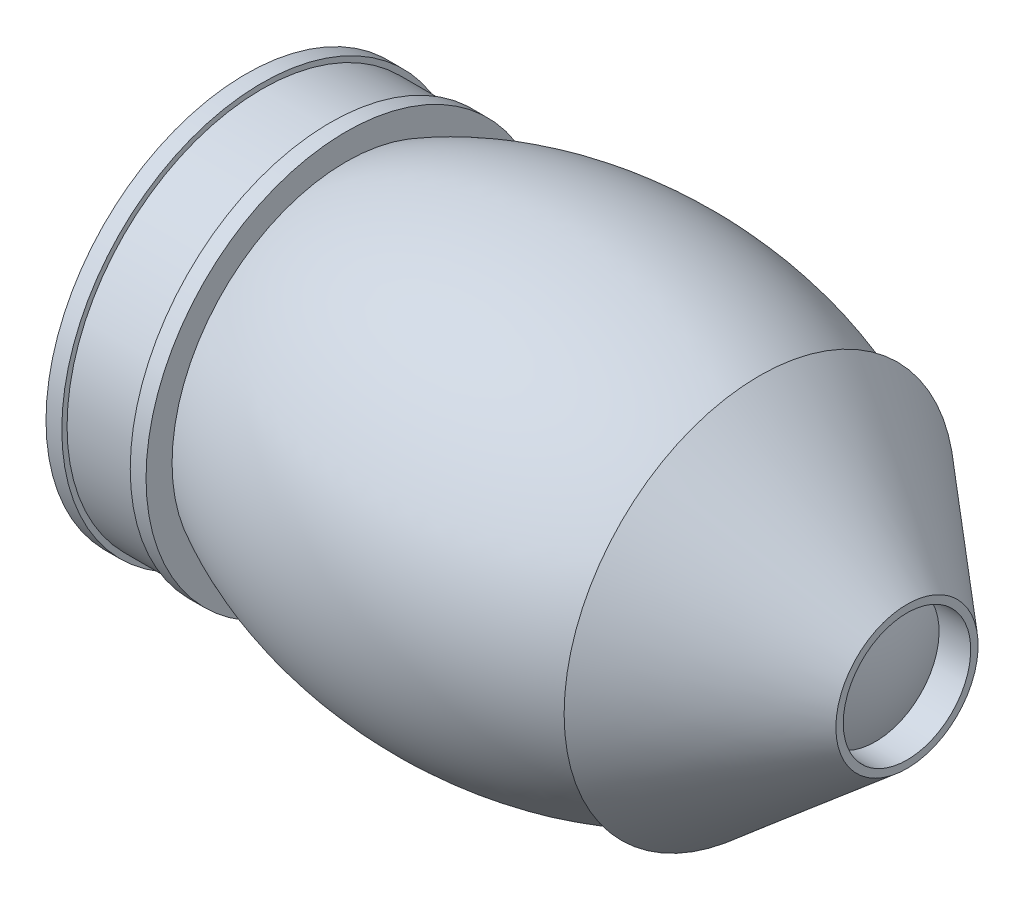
ISO-10303-21;
HEADER;
FILE_DESCRIPTION(('STEP AP214'),'2;1');
FILE_NAME('part.step','',(''),(''),'','','');
FILE_SCHEMA(('AUTOMOTIVE_DESIGN { 1 0 10303 214 1 1 1 1 }'));
ENDSEC;
DATA;
#1=APPLICATION_CONTEXT('core data for automotive mechanical design processes');
#2=APPLICATION_PROTOCOL_DEFINITION('international standard','automotive_design',2000,#1);
#3=PRODUCT_CONTEXT('',#1,'mechanical');
#4=PRODUCT('Part','Part','',(#3));
#5=PRODUCT_RELATED_PRODUCT_CATEGORY('part','',(#4));
#6=PRODUCT_DEFINITION_FORMATION('','',#4);
#7=PRODUCT_DEFINITION_CONTEXT('part definition',#1,'design');
#8=PRODUCT_DEFINITION('design','',#6,#7);
#9=PRODUCT_DEFINITION_SHAPE('','',#8);
#10=(LENGTH_UNIT() NAMED_UNIT(*) SI_UNIT(.MILLI.,.METRE.));
#11=(NAMED_UNIT(*) PLANE_ANGLE_UNIT() SI_UNIT($,.RADIAN.));
#12=(NAMED_UNIT(*) SI_UNIT($,.STERADIAN.) SOLID_ANGLE_UNIT());
#13=UNCERTAINTY_MEASURE_WITH_UNIT(LENGTH_MEASURE(1.E-05),#10,'distance_accuracy_value','');
#14=(GEOMETRIC_REPRESENTATION_CONTEXT(3) GLOBAL_UNCERTAINTY_ASSIGNED_CONTEXT((#13)) GLOBAL_UNIT_ASSIGNED_CONTEXT((#10,
#11,#12)) REPRESENTATION_CONTEXT('',''));
#15=CARTESIAN_POINT('',(0.,0.,0.));
#16=DIRECTION('',(0.,0.,1.));
#17=DIRECTION('',(1.,0.,0.));
#18=AXIS2_PLACEMENT_3D('',#15,#16,#17);
#19=CARTESIAN_POINT('',(63.5,0.,0.));
#20=DIRECTION('',(0.,0.,1.));
#21=DIRECTION('',(-1.,0.,0.));
#22=AXIS2_PLACEMENT_3D('',#19,#20,#21);
#23=ELLIPSE('',#22,95.25,63.5);
#24=TRIMMED_CURVE('',#23,(PARAMETER_VALUE(3.14159265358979)),
(PARAMETER_VALUE(6.28318530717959)),.T.,.PARAMETER.);
#25=CARTESIAN_POINT('',(-100.872846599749,0.,0.));
#26=DIRECTION('',(-1.,0.,0.));
#27=AXIS1_PLACEMENT('',#25,#26);
#28=SURFACE_OF_REVOLUTION('',#24,#27);
#29=CARTESIAN_POINT('',(3.99300739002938,0.,0.));
#30=DIRECTION('',(-1.,0.,0.));
#31=DIRECTION('',(0.,0.,1.));
#32=AXIS2_PLACEMENT_3D('',#29,#30,#31);
#33=CIRCLE('',#32,49.5826149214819);
#34=CARTESIAN_POINT('',(3.99300739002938,0.,49.5826149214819));
#35=VERTEX_POINT('',#34);
#36=EDGE_CURVE('E59',#35,#35,#33,.T.);
#37=ORIENTED_EDGE('',*,*,#36,.F.);
#38=EDGE_LOOP('',(#37));
#39=FACE_BOUND('',#38,.T.);
#40=CARTESIAN_POINT('',(119.373234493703,0.,0.));
#41=DIRECTION('',(-1.,0.,0.));
#42=DIRECTION('',(0.,0.,1.));
#43=AXIS2_PLACEMENT_3D('',#40,#41,#42);
#44=CIRCLE('',#43,51.4273777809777);
#45=CARTESIAN_POINT('',(119.373234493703,0.,51.4273777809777));
#46=VERTEX_POINT('',#45);
#47=EDGE_CURVE('E45',#46,#46,#44,.F.);
#48=ORIENTED_EDGE('',*,*,#47,.F.);
#49=EDGE_LOOP('',(#48));
#50=FACE_BOUND('',#49,.T.);
#51=ADVANCED_FACE('F36',(#39,#50),#28,.T.);
#52=CARTESIAN_POINT('',(-31.75,0.,0.));
#53=VERTEX_POINT('',#52);
#54=VERTEX_LOOP('',#53);
#55=FACE_BOUND('',#54,.T.);
#56=CARTESIAN_POINT('',(-24.5069926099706,0.,0.));
#57=DIRECTION('',(-1.,0.,0.));
#58=DIRECTION('',(0.,0.,1.));
#59=AXIS2_PLACEMENT_3D('',#56,#57,#58);
#60=CIRCLE('',#59,24.2883762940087);
#61=CARTESIAN_POINT('',(-24.5069926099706,0.,24.2883762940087));
#62=VERTEX_POINT('',#61);
#63=EDGE_CURVE('E57',#62,#62,#60,.F.);
#64=ORIENTED_EDGE('',*,*,#63,.F.);
#65=EDGE_LOOP('',(#64));
#66=FACE_BOUND('',#65,.T.);
#67=ADVANCED_FACE('F38',(#55,#66),#28,.T.);
#68=CARTESIAN_POINT('',(-24.5069926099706,57.,0.));
#69=DIRECTION('',(1.,0.,0.));
#70=DIRECTION('',(0.,0.,-1.));
#71=AXIS2_PLACEMENT_3D('',#68,#69,#70);
#72=PLANE('',#71);
#73=CARTESIAN_POINT('',(-24.5069926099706,0.,0.));
#74=DIRECTION('',(-1.,0.,0.));
#75=DIRECTION('',(0.,0.,1.));
#76=AXIS2_PLACEMENT_3D('',#73,#74,#75);
#77=CIRCLE('',#76,57.);
#78=CARTESIAN_POINT('',(-24.5069926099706,0.,57.));
#79=VERTEX_POINT('',#78);
#80=EDGE_CURVE('E78',#79,#79,#77,.T.);
#81=ORIENTED_EDGE('',*,*,#80,.T.);
#82=EDGE_LOOP('',(#81));
#83=FACE_BOUND('',#82,.T.);
#84=ORIENTED_EDGE('',*,*,#63,.T.);
#85=EDGE_LOOP('',(#84));
#86=FACE_BOUND('',#85,.T.);
#87=ADVANCED_FACE('F53',(#83,#86),#72,.F.);
#88=CARTESIAN_POINT('',(3.99300739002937,0.,0.));
#89=DIRECTION('',(-1.,0.,0.));
#90=DIRECTION('',(0.,0.,1.));
#91=AXIS2_PLACEMENT_3D('',#88,#89,#90);
#92=PLANE('',#91);
#93=CARTESIAN_POINT('',(3.99300739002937,0.,0.));
#94=DIRECTION('',(-1.,0.,0.));
#95=DIRECTION('',(0.,0.,1.));
#96=AXIS2_PLACEMENT_3D('',#93,#94,#95);
#97=CIRCLE('',#96,57.);
#98=CARTESIAN_POINT('',(3.99300739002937,0.,57.));
#99=VERTEX_POINT('',#98);
#100=EDGE_CURVE('E81',#99,#99,#97,.T.);
#101=ORIENTED_EDGE('',*,*,#100,.F.);
#102=EDGE_LOOP('',(#101));
#103=FACE_BOUND('',#102,.T.);
#104=ORIENTED_EDGE('',*,*,#36,.T.);
#105=EDGE_LOOP('',(#104));
#106=FACE_BOUND('',#105,.T.);
#107=ADVANCED_FACE('F131',(#103,#106),#92,.F.);
#108=CARTESIAN_POINT('',(-41.4029714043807,0.,0.));
#109=DIRECTION('',(-1.,0.,0.));
#110=DIRECTION('',(0.,0.,1.));
#111=AXIS2_PLACEMENT_3D('',#108,#109,#110);
#112=CYLINDRICAL_SURFACE('',#111,57.);
#113=CARTESIAN_POINT('',(-0.506992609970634,0.,0.));
#114=DIRECTION('',(-1.,0.,0.));
#115=DIRECTION('',(0.,0.,1.));
#116=AXIS2_PLACEMENT_3D('',#113,#114,#115);
#117=CIRCLE('',#116,57.);
#118=CARTESIAN_POINT('',(-0.506992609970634,0.,57.));
#119=VERTEX_POINT('',#118);
#120=EDGE_CURVE('E63',#119,#119,#117,.T.);
#121=ORIENTED_EDGE('',*,*,#120,.F.);
#122=EDGE_LOOP('',(#121));
#123=FACE_BOUND('',#122,.T.);
#124=ORIENTED_EDGE('',*,*,#100,.T.);
#125=EDGE_LOOP('',(#124));
#126=FACE_BOUND('',#125,.T.);
#127=ADVANCED_FACE('F134',(#123,#126),#112,.T.);
#128=CARTESIAN_POINT('',(-0.506992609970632,57.,0.));
#129=DIRECTION('',(1.,0.,0.));
#130=DIRECTION('',(0.,0.,-1.));
#131=AXIS2_PLACEMENT_3D('',#128,#129,#130);
#132=PLANE('',#131);
#133=CARTESIAN_POINT('',(-0.506992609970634,0.,0.));
#134=DIRECTION('',(-1.,0.,0.));
#135=DIRECTION('',(0.,0.,1.));
#136=AXIS2_PLACEMENT_3D('',#133,#134,#135);
#137=CIRCLE('',#136,55.5);
#138=CARTESIAN_POINT('',(-0.506992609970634,0.,55.5));
#139=VERTEX_POINT('',#138);
#140=EDGE_CURVE('E69',#139,#139,#137,.T.);
#141=ORIENTED_EDGE('',*,*,#140,.F.);
#142=EDGE_LOOP('',(#141));
#143=FACE_BOUND('',#142,.T.);
#144=ORIENTED_EDGE('',*,*,#120,.T.);
#145=EDGE_LOOP('',(#144));
#146=FACE_BOUND('',#145,.T.);
#147=ADVANCED_FACE('F149',(#143,#146),#132,.F.);
#148=CARTESIAN_POINT('',(-41.4029714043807,0.,0.));
#149=DIRECTION('',(-1.,0.,0.));
#150=DIRECTION('',(0.,0.,1.));
#151=AXIS2_PLACEMENT_3D('',#148,#149,#150);
#152=CYLINDRICAL_SURFACE('',#151,55.5);
#153=CARTESIAN_POINT('',(-20.0069926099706,0.,0.));
#154=DIRECTION('',(-1.,0.,0.));
#155=DIRECTION('',(0.,0.,1.));
#156=AXIS2_PLACEMENT_3D('',#153,#154,#155);
#157=CIRCLE('',#156,55.5);
#158=CARTESIAN_POINT('',(-20.0069926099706,0.,55.5));
#159=VERTEX_POINT('',#158);
#160=EDGE_CURVE('E72',#159,#159,#157,.T.);
#161=ORIENTED_EDGE('',*,*,#160,.F.);
#162=EDGE_LOOP('',(#161));
#163=FACE_BOUND('',#162,.T.);
#164=ORIENTED_EDGE('',*,*,#140,.T.);
#165=EDGE_LOOP('',(#164));
#166=FACE_BOUND('',#165,.T.);
#167=ADVANCED_FACE('F145',(#163,#166),#152,.T.);
#168=CARTESIAN_POINT('',(-20.0069926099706,55.5,0.));
#169=DIRECTION('',(-1.,0.,0.));
#170=DIRECTION('',(0.,0.,1.));
#171=AXIS2_PLACEMENT_3D('',#168,#169,#170);
#172=PLANE('',#171);
#173=CARTESIAN_POINT('',(-20.0069926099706,0.,0.));
#174=DIRECTION('',(-1.,0.,0.));
#175=DIRECTION('',(0.,0.,1.));
#176=AXIS2_PLACEMENT_3D('',#173,#174,#175);
#177=CIRCLE('',#176,57.);
#178=CARTESIAN_POINT('',(-20.0069926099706,0.,57.));
#179=VERTEX_POINT('',#178);
#180=EDGE_CURVE('E75',#179,#179,#177,.T.);
#181=ORIENTED_EDGE('',*,*,#180,.F.);
#182=EDGE_LOOP('',(#181));
#183=FACE_BOUND('',#182,.T.);
#184=ORIENTED_EDGE('',*,*,#160,.T.);
#185=EDGE_LOOP('',(#184));
#186=FACE_BOUND('',#185,.T.);
#187=ADVANCED_FACE('F141',(#183,#186),#172,.F.);
#188=CARTESIAN_POINT('',(-41.4029714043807,0.,0.));
#189=DIRECTION('',(-1.,0.,0.));
#190=DIRECTION('',(0.,0.,1.));
#191=AXIS2_PLACEMENT_3D('',#188,#189,#190);
#192=CYLINDRICAL_SURFACE('',#191,57.);
#193=ORIENTED_EDGE('',*,*,#80,.F.);
#194=EDGE_LOOP('',(#193));
#195=FACE_BOUND('',#194,.T.);
#196=ORIENTED_EDGE('',*,*,#180,.T.);
#197=EDGE_LOOP('',(#196));
#198=FACE_BOUND('',#197,.T.);
#199=ADVANCED_FACE('F112',(#195,#198),#192,.T.);
#200=CARTESIAN_POINT('',(-41.4029714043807,0.,0.));
#201=DIRECTION('',(-1.,0.,0.));
#202=DIRECTION('',(0.,0.,1.));
#203=AXIS2_PLACEMENT_3D('',#200,#201,#202);
#204=CYLINDRICAL_SURFACE('',#203,18.1540898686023);
#205=CARTESIAN_POINT('',(163.789229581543,0.,0.));
#206=DIRECTION('',(-1.,0.,0.));
#207=DIRECTION('',(0.,0.,1.));
#208=AXIS2_PLACEMENT_3D('',#205,#206,#207);
#209=CIRCLE('',#208,18.1540898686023);
#210=CARTESIAN_POINT('',(163.789229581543,0.,18.1540898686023));
#211=VERTEX_POINT('',#210);
#212=EDGE_CURVE('E84',#211,#211,#209,.T.);
#213=ORIENTED_EDGE('',*,*,#212,.F.);
#214=EDGE_LOOP('',(#213));
#215=FACE_BOUND('',#214,.T.);
#216=CARTESIAN_POINT('',(154.774464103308,0.,0.));
#217=DIRECTION('',(-1.,0.,0.));
#218=DIRECTION('',(0.,0.,1.));
#219=AXIS2_PLACEMENT_3D('',#216,#217,#218);
#220=CIRCLE('',#219,18.1540898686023);
#221=CARTESIAN_POINT('',(154.774464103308,0.,18.1540898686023));
#222=VERTEX_POINT('',#221);
#223=EDGE_CURVE('E11',#222,#222,#220,.T.);
#224=ORIENTED_EDGE('',*,*,#223,.T.);
#225=EDGE_LOOP('',(#224));
#226=FACE_BOUND('',#225,.T.);
#227=ADVANCED_FACE('F109',(#215,#226),#204,.F.);
#228=CARTESIAN_POINT('',(121.748755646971,0.,0.));
#229=DIRECTION('',(1.,0.,0.));
#230=DIRECTION('',(0.,0.,-1.));
#231=AXIS2_PLACEMENT_3D('',#228,#229,#230);
#232=CONICAL_SURFACE('',#231,55.643211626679,1.05766577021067);
#233=CARTESIAN_POINT('',(121.748755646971,0.,0.));
#234=DIRECTION('',(-1.,0.,0.));
#235=DIRECTION('',(0.,0.,1.));
#236=AXIS2_PLACEMENT_3D('',#233,#234,#235);
#237=CIRCLE('',#236,55.643211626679);
#238=CARTESIAN_POINT('',(121.748755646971,0.,55.643211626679));
#239=VERTEX_POINT('',#238);
#240=EDGE_CURVE('E90',#239,#239,#237,.T.);
#241=ORIENTED_EDGE('',*,*,#240,.T.);
#242=EDGE_LOOP('',(#241));
#243=FACE_BOUND('',#242,.T.);
#244=ORIENTED_EDGE('',*,*,#47,.T.);
#245=EDGE_LOOP('',(#244));
#246=FACE_BOUND('',#245,.T.);
#247=ADVANCED_FACE('F94',(#243,#246),#232,.T.);
#248=CARTESIAN_POINT('',(163.789229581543,20.2678038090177,0.));
#249=DIRECTION('',(-1.,0.,0.));
#250=DIRECTION('',(0.,0.,1.));
#251=AXIS2_PLACEMENT_3D('',#248,#249,#250);
#252=PLANE('',#251);
#253=CARTESIAN_POINT('',(163.789229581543,0.,0.));
#254=DIRECTION('',(-1.,0.,0.));
#255=DIRECTION('',(0.,0.,1.));
#256=AXIS2_PLACEMENT_3D('',#253,#254,#255);
#257=CIRCLE('',#256,20.2678038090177);
#258=CARTESIAN_POINT('',(163.789229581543,0.,20.2678038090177));
#259=VERTEX_POINT('',#258);
#260=EDGE_CURVE('E87',#259,#259,#257,.T.);
#261=ORIENTED_EDGE('',*,*,#260,.F.);
#262=EDGE_LOOP('',(#261));
#263=FACE_BOUND('',#262,.T.);
#264=ORIENTED_EDGE('',*,*,#212,.T.);
#265=EDGE_LOOP('',(#264));
#266=FACE_BOUND('',#265,.T.);
#267=ADVANCED_FACE('F100',(#263,#266),#252,.F.);
#268=CARTESIAN_POINT('',(163.789229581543,0.,0.));
#269=DIRECTION('',(-1.,0.,0.));
#270=DIRECTION('',(0.,0.,1.));
#271=AXIS2_PLACEMENT_3D('',#268,#269,#270);
#272=CONICAL_SURFACE('',#271,20.2678038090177,0.699515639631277);
#273=ORIENTED_EDGE('',*,*,#240,.F.);
#274=EDGE_LOOP('',(#273));
#275=FACE_BOUND('',#274,.T.);
#276=ORIENTED_EDGE('',*,*,#260,.T.);
#277=EDGE_LOOP('',(#276));
#278=FACE_BOUND('',#277,.T.);
#279=ADVANCED_FACE('F97',(#275,#278),#272,.T.);
#280=CARTESIAN_POINT('',(158.75,0.,0.));
#281=VERTEX_POINT('',#280);
#282=VERTEX_LOOP('',#281);
#283=FACE_BOUND('',#282,.T.);
#284=ORIENTED_EDGE('',*,*,#223,.F.);
#285=EDGE_LOOP('',(#284));
#286=FACE_BOUND('',#285,.T.);
#287=ADVANCED_FACE('F54',(#283,#286),#28,.T.);
#288=CLOSED_SHELL('',(#51,#67,#87,#107,#127,#147,#167,#187,#199,#227,#247,#267,#279,#287));
#289=MANIFOLD_SOLID_BREP('B2',#288);
#290=ADVANCED_BREP_SHAPE_REPRESENTATION('',(#18,#289),#14);
#291=SHAPE_DEFINITION_REPRESENTATION(#9,#290);
ENDSEC;
END-ISO-10303-21;
